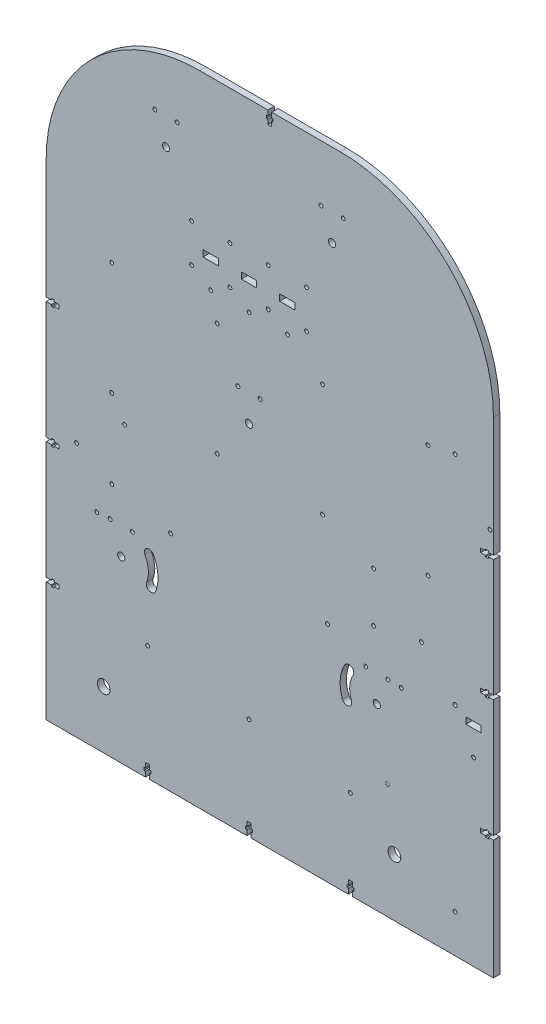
from build123d import *

# Parameters (mm, degrees)
SKETCH1_R           = 1.5
SKETCH1_R_2         = 2.8
SKETCH1_R_3         = 5
BOSS_EXTRUDE1_DEPTH = 5
SKETCH5_R           = 1.5
CUT_EXTRUDE5_DEPTH  = 306.204849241
SKETCH11_W          = 12
SKETCH11_H          = 5
CUT_EXTRUDE6_DEPTH  = 306.204849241
SKETCH15_R          = 1.5
CUT_EXTRUDE9_DEPTH  = 10
SKETCH21_R          = 1.5
CUT_EXTRUDE10_DEPTH = 5
SKETCH23_R          = 1.5
BOSS_EXTRUDE6_DEPTH = 5
SKETCH24_R          = 1.5
SKETCH24_W          = 12
SKETCH24_H          = 5
CUT_EXTRUDE11_DEPTH = 5
SKETCH27_R          = 1.5
CUT_EXTRUDE12_DEPTH = 10
SKETCH28_R          = 1.5
CUT_EXTRUDE13_DEPTH = 10
SKETCH39_R          = 1.5
SKETCH39_R_2        = 1.618203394
SKETCH39_W          = 12
SKETCH39_H          = 5
CUT_EXTRUDE16_DEPTH = 5
SKETCH40_W          = 12
SKETCH40_H          = 5
SKETCH40_R          = 1.5
SKETCH40_R_2        = 1.474506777
BOSS_EXTRUDE8_DEPTH = 5


with BuildPart() as part:
    # Sketch1 → Boss-Extrude1 (new body)
    with BuildSketch(Plane.XY.offset(5)):
        with BuildLine():
            Line((168.8, -57.15), (171, -57.15))
            Line((171, -57.15), (171, -58.5))
            Line((171, -58.5), (175, -58.5))
            Line((175, -58.5), (175, 33.5))
            Line((175, 33.5), (171, 33.5))
            Line((171, 33.5), (171, 32.15))
            Line((171, 32.15), (168.8, 32.15))
            Line((168.8, 32.15), (168.8, 33.3))
            Line((168.8, 33.3), (165, 33.3))
            Line((165, 33.3), (165, 36.5))
            Line((165, 36.5), (168.8, 36.5))
            Line((168.8, 36.5), (168.8, 37.65))
            Line((168.8, 37.65), (171, 37.65))
            Line((171, 37.65), (171, 36.5))
            Line((171, 36.5), (175, 36.5))
            Line((175, 36.5), (175, 130))
            ThreePointArc((175, 130), (139.852813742, 214.852813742), (55, 250))
            Line((55, 250), (1.5, 250))
            Line((1.5, 250), (1.5, 246))
            Line((1.5, 246), (2.65, 246))
            Line((2.65, 246), (2.65, 243.8))
            Line((2.65, 243.8), (1.5, 243.8))
            Line((1.5, 243.8), (1.5, 240))
            Line((1.5, 240), (-1.5, 240))
            Line((-1.5, 240), (-1.5, 243.8))
            Line((-1.5, 243.8), (-2.65, 243.8))
            Line((-2.65, 243.8), (-2.65, 246))
            Line((-2.65, 246), (-1.5, 246))
            Line((-1.5, 246), (-1.5, 250))
            Line((-1.5, 250), (-55, 250))
            ThreePointArc((-55, 250), (-139.852813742, 214.852813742), (-175, 130))
            Line((-175, 130), (-175, 36.5))
            Line((-175, 36.5), (-171, 36.5))
            Line((-171, 36.5), (-171, 37.65))
            Line((-171, 37.65), (-168.8, 37.65))
            Line((-168.8, 37.65), (-168.8, 36.5))
            Line((-168.8, 36.5), (-165, 36.5))
            Line((-165, 36.5), (-165, 33.3))
            Line((-165, 33.3), (-168.8, 33.3))
            Line((-168.8, 33.3), (-168.8, 32.15))
            Line((-168.8, 32.15), (-171, 32.15))
            Line((-171, 32.15), (-171, 33.5))
            Line((-171, 33.5), (-175, 33.5))
            Line((-175, 33.5), (-175, -58.5))
            Line((-175, -58.5), (-171, -58.5))
            Line((-171, -58.5), (-171, -57.15))
            Line((-171, -57.15), (-168.8, -57.15))
            Line((-168.8, -57.15), (-168.8, -58.5))
            Line((-168.8, -58.5), (-165, -58.5))
            Line((-165, -58.5), (-165, -61.5))
            Line((-165, -61.5), (-168.8, -61.5))
            Line((-168.8, -61.5), (-168.8, -62.65))
            Line((-168.8, -62.65), (-171, -62.65))
            Line((-171, -62.65), (-171, -61.5))
            Line((-171, -61.5), (-175, -61.5))
            Line((-175, -61.5), (-175, -153.4))
            Line((-175, -153.4), (-171, -153.4))
            Line((-171, -153.4), (-171, -152.25))
            Line((-171, -152.25), (-168.8, -152.25))
            Line((-168.8, -152.25), (-168.8, -153.4))
            Line((-168.8, -153.4), (-165, -153.4))
            Line((-165, -153.4), (-165, -156.6))
            Line((-165, -156.6), (-168.8, -156.6))
            Line((-168.8, -156.6), (-168.8, -157.75))
            Line((-168.8, -157.75), (-171, -157.75))
            Line((-171, -157.75), (-171, -156.6))
            Line((-171, -156.6), (-175, -156.6))
            Line((-175, -156.6), (-175, -250))
            Line((-175, -250), (-97.225, -250))
            Line((-97.225, -250), (-97.225, -246))
            Line((-97.225, -246), (-98.375, -246))
            Line((-98.375, -246), (-98.375, -243.8))
            Line((-98.375, -243.8), (-97.225, -243.8))
            Line((-97.225, -243.8), (-97.225, -240))
            Line((-97.225, -240), (-94.025, -240))
            Line((-94.025, -240), (-94.025, -243.8))
            Line((-94.025, -243.8), (-92.875, -243.8))
            Line((-92.875, -243.8), (-92.875, -246))
            Line((-92.875, -246), (-94.025, -246))
            Line((-94.025, -246), (-94.025, -250))
            Line((-94.025, -250), (-17.85, -250))
            Line((-17.85, -250), (-17.85, -246))
            Line((-17.85, -246), (-19, -246))
            Line((-19, -246), (-19, -243.8))
            Line((-19, -243.8), (-17.85, -243.8))
            Line((-17.85, -243.8), (-17.85, -240))
            Line((-17.85, -240), (-14.65, -240))
            Line((-14.65, -240), (-14.65, -243.8))
            Line((-14.65, -243.8), (-13.5, -243.8))
            Line((-13.5, -243.8), (-13.5, -246))
            Line((-13.5, -246), (-14.65, -246))
            Line((-14.65, -246), (-14.65, -250))
            Line((-14.65, -250), (61.525, -250))
            Line((61.525, -250), (61.525, -246))
            Line((61.525, -246), (60.375, -246))
            Line((60.375, -246), (60.375, -243.8))
            Line((60.375, -243.8), (61.525, -243.8))
            Line((61.525, -243.8), (61.525, -240))
            Line((61.525, -240), (64.725, -240))
            Line((64.725, -240), (64.725, -243.8))
            Line((64.725, -243.8), (65.875, -243.8))
            Line((65.875, -243.8), (65.875, -246))
            Line((65.875, -246), (64.725, -246))
            Line((64.725, -246), (64.725, -250))
            Line((64.725, -250), (175, -250))
            Line((175, -250), (175, -156.6))
            Line((175, -156.6), (171, -156.6))
            Line((171, -156.6), (171, -157.75))
            Line((171, -157.75), (168.8, -157.75))
            Line((168.8, -157.75), (168.8, -156.6))
            Line((168.8, -156.6), (165, -156.6))
            Line((165, -156.6), (165, -153.4))
            Line((165, -153.4), (168.8, -153.4))
            Line((168.8, -153.4), (168.8, -152.25))
            Line((168.8, -152.25), (171, -152.25))
            Line((171, -152.25), (171, -153.4))
            Line((171, -153.4), (175, -153.4))
            Line((175, -153.4), (175, -61.5))
            Line((175, -61.5), (171, -61.5))
            Line((171, -61.5), (171, -62.65))
            Line((171, -62.65), (168.8, -62.65))
            Line((168.8, -62.65), (168.8, -61.5))
            Line((168.8, -61.5), (165, -61.5))
            Line((165, -61.5), (165, -58.5))
            Line((165, -58.5), (168.8, -58.5))
            Line((168.8, -58.5), (168.8, -57.15))
        make_face()
        with Locations(Location((-123.688145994, -64.60317464, 0), (0, 0, 180))):
            Circle(SKETCH1_R, mode=Mode.SUBTRACT)
        with Locations(Location((-96.498912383, -77.281722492, 0), (0, 0, 180))):
            Circle(SKETCH1_R, mode=Mode.SUBTRACT)
        with Locations(Location((91.188145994, -19.60317464, 0), (0, 0, 180))):
            Circle(SKETCH1_R, mode=Mode.SUBTRACT)
        with Locations(Location((91.188145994, -64.60317464, 0), (0, 0, 180))):
            Circle(SKETCH1_R, mode=Mode.SUBTRACT)
        with Locations(Location((63.998912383, -77.281722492, 0), (0, 0, 180))):
            Circle(SKETCH1_R, mode=Mode.SUBTRACT)
        with Locations(Location((-123.688145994, -19.60317464, 0), (0, 0, 180))):
            Circle(SKETCH1_R, mode=Mode.SUBTRACT)
        with Locations(Location((48.75, 185, 0), (0, 0, 180))):
            Circle(SKETCH1_R_2, mode=Mode.SUBTRACT)
        with Locations(Location((-16.25, 30, 0), (0, 0, 180))):
            Circle(SKETCH1_R_2, mode=Mode.SUBTRACT)
        with Locations(Location((-81.25, 185, 0), (0, 0, 180))):
            Circle(SKETCH1_R_2, mode=Mode.SUBTRACT)
        with Locations(Location((-116.25, -110, 0), (0, 0, 180))):
            Circle(SKETCH1_R_2, mode=Mode.SUBTRACT)
        with Locations(Location((83.75, -110, 0), (0, 0, 180))):
            Circle(SKETCH1_R_2, mode=Mode.SUBTRACT)
        with Locations(Location((-130, -205, 0), (0, 0, 180))):
            Circle(SKETCH1_R_3, mode=Mode.SUBTRACT)
        with Locations(Location((97.5, -205, 0), (0, 0, 180))):
            Circle(SKETCH1_R_3, mode=Mode.SUBTRACT)
        with Locations(Location((172.25, 52.5, 0), (0, 0, 180))):
            Circle(SKETCH1_R, mode=Mode.SUBTRACT)
        with Locations(Location((118.688145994, -50.52993116, 0), (0, 0, 180))):
            Circle(SKETCH1_R, mode=Mode.SUBTRACT)
        with Locations(Location((102.876510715, -89.495693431, 0), (0, 0, 180))):
            Circle(SKETCH1_R, mode=Mode.SUBTRACT)
        with Locations(Location((-151.188145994, -50.52993116, 0), (0, 0, 180))):
            Circle(SKETCH1_R, mode=Mode.SUBTRACT)
        with Locations(Location((-135.376510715, -89.495693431, 0), (0, 0, 180))):
            Circle(SKETCH1_R, mode=Mode.SUBTRACT)
        with Locations(Location((-1.25, 145, 0), (0, 0, 180))):
            Circle(SKETCH1_R, mode=Mode.SUBTRACT)
        with Locations(Location((28.75, 115, 0), (0, 0, 180))):
            Circle(SKETCH1_R, mode=Mode.SUBTRACT)
        with Locations(Location((-1.25, 115, 0), (0, 0, 180))):
            Circle(SKETCH1_R, mode=Mode.SUBTRACT)
        with Locations(Location((-31.25, 115, 0), (0, 0, 180))):
            Circle(SKETCH1_R, mode=Mode.SUBTRACT)
        with Locations(Location((-61.25, 115, 0), (0, 0, 180))):
            Circle(SKETCH1_R, mode=Mode.SUBTRACT)
        with Locations(Location((-61.25, 145, 0), (0, 0, 180))):
            Circle(SKETCH1_R, mode=Mode.SUBTRACT)
        with Locations(Location((-31.25, 145, 0), (0, 0, 180))):
            Circle(SKETCH1_R, mode=Mode.SUBTRACT)
        with Locations(Location((28.75, 145, 0), (0, 0, 180))):
            Circle(SKETCH1_R, mode=Mode.SUBTRACT)
        with Locations(Location((145, -113, 0), (0, 0, 180))):
            Circle(SKETCH1_R, mode=Mode.SUBTRACT)
        with Locations(Location((145, -54, 0), (0, 0, 180))):
            Circle(SKETCH1_R, mode=Mode.SUBTRACT)
        with Locations(Location((145, 5, 0), (0, 0, 180))):
            Circle(SKETCH1_R, mode=Mode.SUBTRACT)
        with Locations(Location((145, -220, 0), (0, 0, 180))):
            Circle(SKETCH1_R, mode=Mode.SUBTRACT)
        with BuildLine():
            ThreePointArc((65.219762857, -99.598422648), (62.560005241, -108.40418606), (63.87092263, -117.50898015))
            ThreePointArc((63.87092263, -117.50898015), (61.70561862, -122.335447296), (56.86830547, -120.194483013))
            ThreePointArc((56.86830547, -120.194483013), (55.078536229, -107.878644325), (58.661352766, -95.960314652))
            ThreePointArc((58.661352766, -95.960314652), (63.768798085, -94.483603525), (65.219762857, -99.598422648))
        make_face(mode=Mode.SUBTRACT)
        with BuildLine():
            ThreePointArc((-89.36830547, -120.194483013), (-94.20561862, -122.335447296), (-96.37092263, -117.50898015))
            ThreePointArc((-96.37092263, -117.50898015), (-95.060005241, -108.40418606), (-97.719762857, -99.598422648))
            ThreePointArc((-97.719762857, -99.598422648), (-96.268798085, -94.483603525), (-91.161352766, -95.960314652))
            ThreePointArc((-91.161352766, -95.960314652), (-87.578536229, -107.878644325), (-89.36830547, -120.194483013))
        make_face(mode=Mode.SUBTRACT)
    extrude(amount=-BOSS_EXTRUDE1_DEPTH)

    # Sketch5 → Cut-Extrude5 (cut, through all)
    with BuildSketch(Plane.XY):
        with Locations((92.45, -88.9)):
            Circle(SKETCH5_R)
        with Locations((75.05, -88.9)):
            Circle(SKETCH5_R)
        with Locations((-107.55, -88.9)):
            Circle(SKETCH5_R)
        with Locations((-124.95, -88.9)):
            Circle(SKETCH5_R)
        with Locations((-7.55, 51.1)):
            Circle(SKETCH5_R)
        with Locations((-24.95, 51.1)):
            Circle(SKETCH5_R)
        with Locations((-89.95, 206.1)):
            Circle(SKETCH5_R)
        with Locations((-72.55, 206.1)):
            Circle(SKETCH5_R)
        with Locations((40.05, 206.1)):
            Circle(SKETCH5_R)
        with Locations((57.45, 206.1)):
            Circle(SKETCH5_R)
    extrude(amount=CUT_EXTRUDE5_DEPTH, mode=Mode.SUBTRACT)

    # Sketch11 → Cut-Extrude6 (cut, through all)
    with BuildSketch(Plane(origin=(0, 0, 0), x_dir=(-1, 0, 0), z_dir=(0, 0, -1))):
        with Locations((-13.75, 127.5)):
            Rectangle(SKETCH11_W, SKETCH11_H)
        with Locations((16.25, 127.5)):
            Rectangle(SKETCH11_W, SKETCH11_H)
        with Locations((46.25, 127.5)):
            Rectangle(SKETCH11_W, SKETCH11_H)
    extrude(amount=-CUT_EXTRUDE6_DEPTH, mode=Mode.SUBTRACT)

    # Sketch15 → Cut-Extrude9 (cut)
    with BuildSketch(Plane(origin=(0, 0, 0), x_dir=(-1, 0, 0), z_dir=(0, 0, -1))):
        with Locations((-13.75, 105.5)):
            Circle(SKETCH15_R)
        with Locations((16.25, 105.5)):
            Circle(SKETCH15_R)
        with Locations((46.25, 105.5)):
            Circle(SKETCH15_R)
    extrude(amount=-CUT_EXTRUDE9_DEPTH, mode=Mode.SUBTRACT)

    # Sketch21 → Cut-Extrude10 (cut)
    with BuildSketch(Plane.XY.offset(5)):
        with Locations((81.188145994, -19.352057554)):
            Circle(SKETCH21_R)
        with Locations((81.188145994, -58.232472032)):
            Circle(SKETCH21_R)
        with Locations((45.149947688, -75.037359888)):
            Circle(SKETCH21_R)
        with Locations(Location((-77.649947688, -75.037359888, 0), (0, 0, 180))):
            Circle(SKETCH21_R)
        with Locations(Location((-113.688145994, -58.232472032, 0), (0, 0, 180))):
            Circle(SKETCH21_R)
        with Locations(Location((-113.688145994, -19.352057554, 0), (0, 0, 180))):
            Circle(SKETCH21_R)
    extrude(amount=-CUT_EXTRUDE10_DEPTH, mode=Mode.SUBTRACT)

    # Sketch23 → Boss-Extrude6 (add)
    with BuildSketch(Plane.XY.offset(5)):
        with Locations((91.188145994, -19.60317464)):
            Circle(SKETCH23_R)
        with Locations((91.188145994, -64.60317464)):
            Circle(SKETCH23_R)
        with Locations((63.998912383, -77.281722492)):
            Circle(SKETCH23_R)
        with Locations((-123.688145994, -19.60317464)):
            Circle(SKETCH23_R)
        with Locations((-113.688145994, -58.232472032)):
            Circle(SKETCH23_R)
        with Locations((-96.498912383, -77.281722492)):
            Circle(SKETCH23_R)
    extrude(amount=-BOSS_EXTRUDE6_DEPTH)

    # Sketch24 → Cut-Extrude11 (cut)
    with BuildSketch(Plane(origin=(0, 0, 0), x_dir=(1, 0, 0), z_dir=(0, 0, -1))):
        with Locations(Location((159.437231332, 206.382230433, 0), (0, 0, 180))):
            Circle(SKETCH24_R)
        with Locations((159.458678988, 184.382230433)):
            Rectangle(SKETCH24_W, SKETCH24_H)
    extrude(amount=-CUT_EXTRUDE11_DEPTH, mode=Mode.SUBTRACT)

    # Sketch27 → Cut-Extrude12 (cut)
    with BuildSketch(Plane(origin=(0, 0, 0), x_dir=(-1, 0, 0), z_dir=(0, 0, -1))):
        with Locations((-123.75, 85.481343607)):
            Circle(SKETCH27_R)
        with Locations((-123.750271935, -2.850923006)):
            Circle(SKETCH27_R)
        with Locations(Location((-41.249728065, -2.850923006, 0), (0, 0, 180))):
            Circle(SKETCH27_R)
        with Locations(Location((-41.25, 85.481343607, 0), (0, 0, 180))):
            Circle(SKETCH27_R)
        with Locations(Location((123.75, 85.481343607, 0), (0, 0, 180))):
            Circle(SKETCH27_R)
        with Locations(Location((123.750271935, -2.850923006, 0), (0, 0, 180))):
            Circle(SKETCH27_R)
        with Locations((41.249728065, -2.850923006)):
            Circle(SKETCH27_R)
        with Locations((41.25, 85.481343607)):
            Circle(SKETCH27_R)
    extrude(amount=-CUT_EXTRUDE12_DEPTH, mode=Mode.SUBTRACT)

    # Sketch28 → Cut-Extrude13 (cut)
    with BuildSketch(Plane(origin=(0, 0, 0), x_dir=(-1, 0, 0), z_dir=(0, 0, -1))):
        with Locations((-92.04310068, -160.116069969)):
            Circle(SKETCH28_R)
        with Locations((-15.65, -169.46)):
            Circle(SKETCH28_R)
        with Locations((61.10689932, -178.826069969)):
            Circle(SKETCH28_R)
    extrude(amount=-CUT_EXTRUDE13_DEPTH, mode=Mode.SUBTRACT)

    # Sketch39 → Cut-Extrude16 (cut)
    with BuildSketch(Plane(origin=(0, 0, 0), x_dir=(-1, 0, 0), z_dir=(0, 0, -1))):
        with Locations((-159.458678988, -108.263656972)):
            Circle(SKETCH39_R)
        with Locations((95.647415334, -160.157130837)):
            Circle(SKETCH39_R)
        with Locations((16.294830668, -170.314261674)):
            Circle(SKETCH39_R)
        with Locations((-63.057753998, -180.471392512)):
            Circle(SKETCH39_R)
        with Locations((-145, -80)):
            Circle(SKETCH39_R_2)
        with Locations((-145, 90)):
            Circle(SKETCH39_R)
        with Locations((-159.458678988, -86.263656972)):
            Rectangle(SKETCH39_W, SKETCH39_H)
    extrude(amount=-CUT_EXTRUDE16_DEPTH, mode=Mode.SUBTRACT)

    # Sketch40 → Boss-Extrude8 (add)
    with BuildSketch(Plane(origin=(0, 0, 0), x_dir=(-1, 0, 0), z_dir=(0, 0, -1))):
        with Locations((-159.458678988, -184.382230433)):
            Rectangle(SKETCH40_W, SKETCH40_H)
        with Locations((61.10689932, -178.826069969)):
            Circle(SKETCH40_R)
        with Locations((-15.65, -169.46)):
            Circle(SKETCH40_R)
        with Locations((-92.04310068, -160.116069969)):
            Circle(SKETCH40_R_2)
        with Locations((-145, -54)):
            Circle(SKETCH40_R)
        with Locations((-145, 5)):
            Circle(SKETCH40_R)
        with Locations((-145, -113)):
            Circle(SKETCH40_R)
        with Locations((-159.437231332, -206.382230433)):
            Circle(SKETCH40_R)
    extrude(amount=-BOSS_EXTRUDE8_DEPTH)


with BuildPart() as boss_extrude8_piece_1:
    # of the separate pieces the step leaves, piece 1, a body of its own (boss_extrude8_pieces)
    add(part.part.solids().sort_by_distance((175, -250, 5))[0])


with BuildPart() as boss_extrude8_piece_2:
    # of the separate pieces the step leaves, piece 2, a body of its own (boss_extrude8_pieces)
    add(part.part.solids().sort_by_distance((90.568593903, -160.116069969, 0))[0])


solid = Compound([boss_extrude8_piece_1.part, boss_extrude8_piece_2.part])
